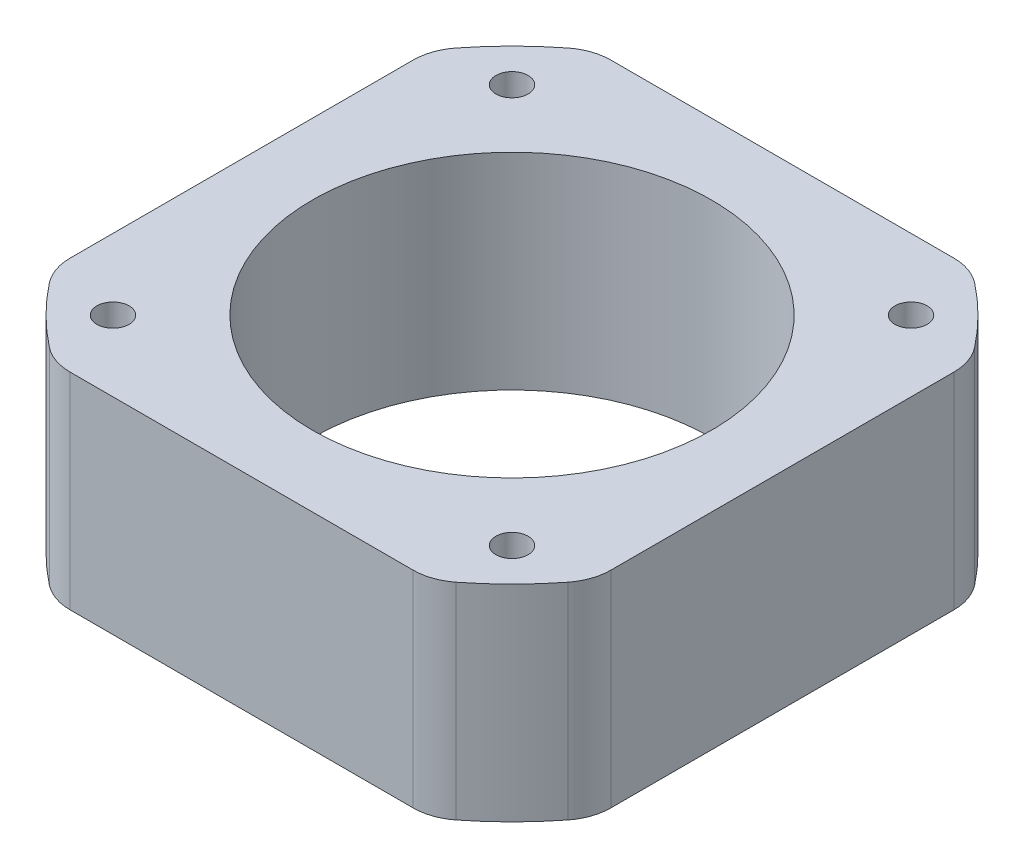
from build123d import *

# Parameters (mm, degrees)
SKETCH_1_R      = 1.25
SKETCH_1_R_2    = 15.5
EXTRUDE_1_DEPTH = 16
FILLET_1_R      = 4


with BuildPart() as part:
    # Sketch 1 → Extrude 1 (new body)
    with BuildSketch(Plane(origin=(0, 0, 0), x_dir=(1, 0, 0), z_dir=(0, 1, 0))):
        with BuildLine():
            Line((-14.641038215, -21), (14.641038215, -21))
            ThreePointArc((14.641038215, -21), (18.101933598, -18.101933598), (21, -14.641038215))
            Line((21, -14.641038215), (21, 14.641038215))
            ThreePointArc((21, 14.641038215), (18.101933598, 18.101933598), (14.641038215, 21))
            Line((14.641038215, 21), (-14.641038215, 21))
            ThreePointArc((-14.641038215, 21), (-18.101933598, 18.101933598), (-21, 14.641038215))
            Line((-21, 14.641038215), (-21, -14.641038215))
            ThreePointArc((-21, -14.641038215), (-18.101933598, -18.101933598), (-14.641038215, -21))
        make_face()
        with Locations(Location((-15.5, 15.5, 0), (0, 0, 270))):
            Circle(SKETCH_1_R, mode=Mode.SUBTRACT)
        with Locations(Location((15.5, 15.5, 0), (0, 0, 270))):
            Circle(SKETCH_1_R, mode=Mode.SUBTRACT)
        with Locations(Location((15.5, -15.5, 0), (0, 0, 270))):
            Circle(SKETCH_1_R, mode=Mode.SUBTRACT)
        with Locations(Location((-15.5, -15.5, 0), (0, 0, 270))):
            Circle(SKETCH_1_R, mode=Mode.SUBTRACT)
        with Locations(Location((0, 0, 0), (0, 0, 270))):
            Circle(SKETCH_1_R_2, mode=Mode.SUBTRACT)
    extrude(amount=EXTRUDE_1_DEPTH)

    # Fillet 1
    fillet_1_edges = [part.edges().sort_by_distance(p)[0] for p in [
        (21, 8, -14.641038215),
        (21, 8, 14.641038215),
        (14.641038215, 8, 21),
        (-14.641038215, 8, 21),
        (-21, 8, 14.641038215),
        (-21, 8, -14.641038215),
        (-14.641038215, 8, -21),
        (14.641038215, 8, -21),
    ]]
    fillet(fillet_1_edges, radius=FILLET_1_R)


solid = part.part
